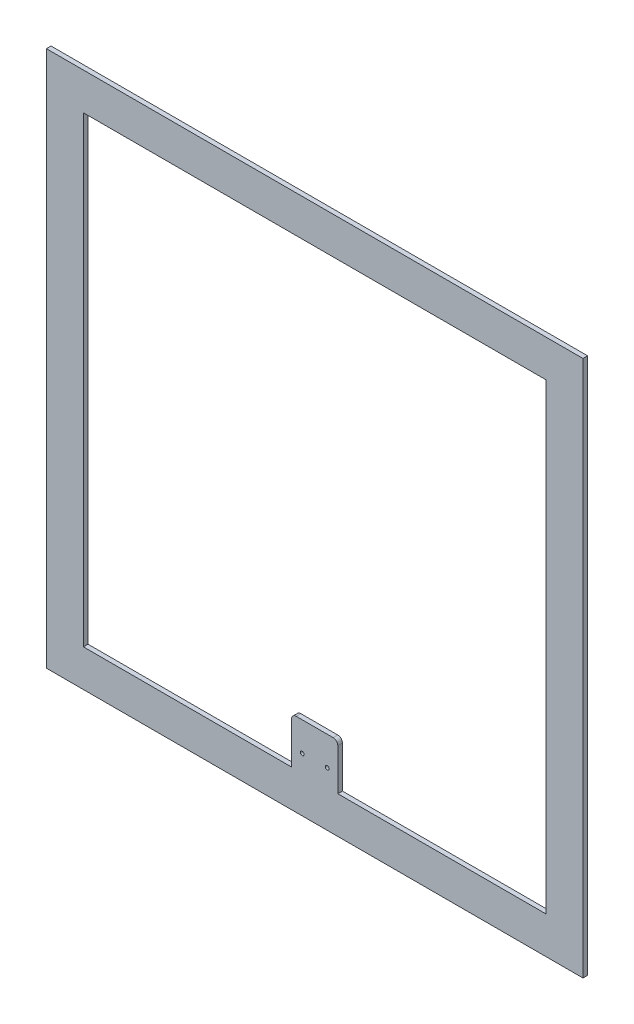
ISO-10303-21;
HEADER;
FILE_DESCRIPTION(('STEP AP214'),'2;1');
FILE_NAME('part.step','',(''),(''),'','','');
FILE_SCHEMA(('AUTOMOTIVE_DESIGN { 1 0 10303 214 1 1 1 1 }'));
ENDSEC;
DATA;
#1=APPLICATION_CONTEXT('core data for automotive mechanical design processes');
#2=APPLICATION_PROTOCOL_DEFINITION('international standard','automotive_design',2000,#1);
#3=PRODUCT_CONTEXT('',#1,'mechanical');
#4=PRODUCT('Part','Part','',(#3));
#5=PRODUCT_RELATED_PRODUCT_CATEGORY('part','',(#4));
#6=PRODUCT_DEFINITION_FORMATION('','',#4);
#7=PRODUCT_DEFINITION_CONTEXT('part definition',#1,'design');
#8=PRODUCT_DEFINITION('design','',#6,#7);
#9=PRODUCT_DEFINITION_SHAPE('','',#8);
#10=(LENGTH_UNIT() NAMED_UNIT(*) SI_UNIT(.MILLI.,.METRE.));
#11=(NAMED_UNIT(*) PLANE_ANGLE_UNIT() SI_UNIT($,.RADIAN.));
#12=(NAMED_UNIT(*) SI_UNIT($,.STERADIAN.) SOLID_ANGLE_UNIT());
#13=UNCERTAINTY_MEASURE_WITH_UNIT(LENGTH_MEASURE(1.E-05),#10,'distance_accuracy_value','');
#14=(GEOMETRIC_REPRESENTATION_CONTEXT(3) GLOBAL_UNCERTAINTY_ASSIGNED_CONTEXT((#13)) GLOBAL_UNIT_ASSIGNED_CONTEXT((#10,
#11,#12)) REPRESENTATION_CONTEXT('',''));
#15=CARTESIAN_POINT('',(0.,0.,0.));
#16=DIRECTION('',(0.,0.,1.));
#17=DIRECTION('',(1.,0.,0.));
#18=AXIS2_PLACEMENT_3D('',#15,#16,#17);
#19=CARTESIAN_POINT('',(0.,0.,5.));
#20=DIRECTION('',(0.,0.,1.));
#21=DIRECTION('',(1.,0.,0.));
#22=AXIS2_PLACEMENT_3D('',#19,#20,#21);
#23=PLANE('',#22);
#24=CARTESIAN_POINT('',(13.5,-231.5,5.));
#25=DIRECTION('',(0.,0.,1.));
#26=DIRECTION('',(-1.,0.,0.));
#27=AXIS2_PLACEMENT_3D('',#24,#25,#26);
#28=CIRCLE('',#27,2.);
#29=CARTESIAN_POINT('',(11.5,-231.5,5.));
#30=VERTEX_POINT('',#29);
#31=EDGE_CURVE('E305',#30,#30,#28,.T.);
#32=ORIENTED_EDGE('',*,*,#31,.F.);
#33=EDGE_LOOP('',(#32));
#34=FACE_BOUND('',#33,.T.);
#35=CARTESIAN_POINT('',(-13.5,-231.5,5.));
#36=DIRECTION('',(0.,0.,1.));
#37=DIRECTION('',(1.,0.,0.));
#38=AXIS2_PLACEMENT_3D('',#35,#36,#37);
#39=CIRCLE('',#38,2.);
#40=CARTESIAN_POINT('',(-11.5,-231.5,5.));
#41=VERTEX_POINT('',#40);
#42=EDGE_CURVE('E309',#41,#41,#39,.T.);
#43=ORIENTED_EDGE('',*,*,#42,.F.);
#44=EDGE_LOOP('',(#43));
#45=FACE_BOUND('',#44,.T.);
#46=DIRECTION('',(0.,1.,0.));
#47=VECTOR('',#46,1.);
#48=CARTESIAN_POINT('',(290.,290.,5.));
#49=LINE('',#48,#47);
#50=CARTESIAN_POINT('',(290.,-290.,5.));
#51=VERTEX_POINT('',#50);
#52=CARTESIAN_POINT('',(290.,290.,5.));
#53=VERTEX_POINT('',#52);
#54=EDGE_CURVE('E203',#51,#53,#49,.T.);
#55=ORIENTED_EDGE('',*,*,#54,.T.);
#56=DIRECTION('',(-1.,0.,0.));
#57=VECTOR('',#56,1.);
#58=CARTESIAN_POINT('',(-290.,290.,5.));
#59=LINE('',#58,#57);
#60=CARTESIAN_POINT('',(-290.,290.,5.));
#61=VERTEX_POINT('',#60);
#62=EDGE_CURVE('E206',#53,#61,#59,.T.);
#63=ORIENTED_EDGE('',*,*,#62,.T.);
#64=DIRECTION('',(0.,-1.,0.));
#65=VECTOR('',#64,1.);
#66=CARTESIAN_POINT('',(-290.,290.,5.));
#67=LINE('',#66,#65);
#68=CARTESIAN_POINT('',(-290.,-290.,5.));
#69=VERTEX_POINT('',#68);
#70=EDGE_CURVE('E209',#61,#69,#67,.T.);
#71=ORIENTED_EDGE('',*,*,#70,.T.);
#72=DIRECTION('',(1.,0.,0.));
#73=VECTOR('',#72,1.);
#74=CARTESIAN_POINT('',(-290.,-290.,5.));
#75=LINE('',#74,#73);
#76=EDGE_CURVE('E211',#69,#51,#75,.T.);
#77=ORIENTED_EDGE('',*,*,#76,.T.);
#78=EDGE_LOOP('',(#55,#63,#71,#77));
#79=FACE_BOUND('',#78,.T.);
#80=DIRECTION('',(0.,-1.,0.));
#81=VECTOR('',#80,1.);
#82=CARTESIAN_POINT('',(25.,-200.,5.));
#83=LINE('',#82,#81);
#84=CARTESIAN_POINT('',(25.,-205.,5.));
#85=VERTEX_POINT('',#84);
#86=CARTESIAN_POINT('',(25.,-250.,5.));
#87=VERTEX_POINT('',#86);
#88=EDGE_CURVE('E173',#85,#87,#83,.T.);
#89=ORIENTED_EDGE('',*,*,#88,.F.);
#90=CARTESIAN_POINT('',(20.,-205.,5.));
#91=DIRECTION('',(0.,0.,1.));
#92=DIRECTION('',(1.,0.,0.));
#93=AXIS2_PLACEMENT_3D('',#90,#91,#92);
#94=CIRCLE('',#93,5.);
#95=CARTESIAN_POINT('',(19.9999999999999,-200.,5.));
#96=VERTEX_POINT('',#95);
#97=EDGE_CURVE('E40',#85,#96,#94,.T.);
#98=ORIENTED_EDGE('',*,*,#97,.T.);
#99=DIRECTION('',(1.,0.,0.));
#100=VECTOR('',#99,1.);
#101=CARTESIAN_POINT('',(-25.,-200.,5.));
#102=LINE('',#101,#100);
#103=CARTESIAN_POINT('',(-20.,-200.,5.));
#104=VERTEX_POINT('',#103);
#105=EDGE_CURVE('E170',#104,#96,#102,.T.);
#106=ORIENTED_EDGE('',*,*,#105,.F.);
#107=CARTESIAN_POINT('',(-20.,-205.,5.));
#108=DIRECTION('',(0.,0.,1.));
#109=DIRECTION('',(1.,0.,0.));
#110=AXIS2_PLACEMENT_3D('',#107,#108,#109);
#111=CIRCLE('',#110,5.);
#112=CARTESIAN_POINT('',(-25.,-205.,5.));
#113=VERTEX_POINT('',#112);
#114=EDGE_CURVE('E47',#104,#113,#111,.T.);
#115=ORIENTED_EDGE('',*,*,#114,.T.);
#116=DIRECTION('',(0.,1.,0.));
#117=VECTOR('',#116,1.);
#118=CARTESIAN_POINT('',(-25.,-200.,5.));
#119=LINE('',#118,#117);
#120=CARTESIAN_POINT('',(-25.,-250.,5.));
#121=VERTEX_POINT('',#120);
#122=EDGE_CURVE('E168',#121,#113,#119,.T.);
#123=ORIENTED_EDGE('',*,*,#122,.F.);
#124=DIRECTION('',(1.,0.,0.));
#125=VECTOR('',#124,1.);
#126=CARTESIAN_POINT('',(-250.,-250.,5.));
#127=LINE('',#126,#125);
#128=CARTESIAN_POINT('',(-250.,-250.,5.));
#129=VERTEX_POINT('',#128);
#130=EDGE_CURVE('E166',#129,#121,#127,.T.);
#131=ORIENTED_EDGE('',*,*,#130,.F.);
#132=DIRECTION('',(0.,-1.,0.));
#133=VECTOR('',#132,1.);
#134=CARTESIAN_POINT('',(-250.,250.,5.));
#135=LINE('',#134,#133);
#136=CARTESIAN_POINT('',(-250.,250.,5.));
#137=VERTEX_POINT('',#136);
#138=EDGE_CURVE('E161',#137,#129,#135,.T.);
#139=ORIENTED_EDGE('',*,*,#138,.F.);
#140=DIRECTION('',(-1.,0.,0.));
#141=VECTOR('',#140,1.);
#142=CARTESIAN_POINT('',(-250.,250.,5.));
#143=LINE('',#142,#141);
#144=CARTESIAN_POINT('',(250.,250.,5.));
#145=VERTEX_POINT('',#144);
#146=EDGE_CURVE('E159',#145,#137,#143,.T.);
#147=ORIENTED_EDGE('',*,*,#146,.F.);
#148=DIRECTION('',(0.,1.,0.));
#149=VECTOR('',#148,1.);
#150=CARTESIAN_POINT('',(250.,250.,5.));
#151=LINE('',#150,#149);
#152=CARTESIAN_POINT('',(250.,-250.,5.));
#153=VERTEX_POINT('',#152);
#154=EDGE_CURVE('E146',#153,#145,#151,.T.);
#155=ORIENTED_EDGE('',*,*,#154,.F.);
#156=DIRECTION('',(1.,0.,0.));
#157=VECTOR('',#156,1.);
#158=CARTESIAN_POINT('',(25.,-250.,5.));
#159=LINE('',#158,#157);
#160=EDGE_CURVE('E137',#87,#153,#159,.T.);
#161=ORIENTED_EDGE('',*,*,#160,.F.);
#162=EDGE_LOOP('',(#89,#98,#106,#115,#123,#131,#139,#147,#155,#161));
#163=FACE_BOUND('',#162,.T.);
#164=ADVANCED_FACE('F32',(#34,#45,#79,#163),#23,.T.);
#165=CARTESIAN_POINT('',(0.,0.,0.));
#166=DIRECTION('',(0.,0.,1.));
#167=DIRECTION('',(1.,0.,0.));
#168=AXIS2_PLACEMENT_3D('',#165,#166,#167);
#169=PLANE('',#168);
#170=CARTESIAN_POINT('',(13.5,-231.5,0.));
#171=DIRECTION('',(0.,0.,1.));
#172=DIRECTION('',(1.,0.,0.));
#173=AXIS2_PLACEMENT_3D('',#170,#171,#172);
#174=CIRCLE('',#173,2.);
#175=CARTESIAN_POINT('',(15.5,-231.5,0.));
#176=VERTEX_POINT('',#175);
#177=EDGE_CURVE('E308',#176,#176,#174,.F.);
#178=ORIENTED_EDGE('',*,*,#177,.F.);
#179=EDGE_LOOP('',(#178));
#180=FACE_BOUND('',#179,.T.);
#181=CARTESIAN_POINT('',(-13.5,-231.5,0.));
#182=DIRECTION('',(0.,0.,1.));
#183=DIRECTION('',(1.,0.,0.));
#184=AXIS2_PLACEMENT_3D('',#181,#182,#183);
#185=CIRCLE('',#184,2.);
#186=CARTESIAN_POINT('',(-11.5,-231.5,0.));
#187=VERTEX_POINT('',#186);
#188=EDGE_CURVE('E177',#187,#187,#185,.F.);
#189=ORIENTED_EDGE('',*,*,#188,.F.);
#190=EDGE_LOOP('',(#189));
#191=FACE_BOUND('',#190,.T.);
#192=DIRECTION('',(0.,1.,0.));
#193=VECTOR('',#192,1.);
#194=CARTESIAN_POINT('',(290.,290.,0.));
#195=LINE('',#194,#193);
#196=CARTESIAN_POINT('',(290.,-290.,0.));
#197=VERTEX_POINT('',#196);
#198=CARTESIAN_POINT('',(290.,290.,0.));
#199=VERTEX_POINT('',#198);
#200=EDGE_CURVE('E154',#197,#199,#195,.T.);
#201=ORIENTED_EDGE('',*,*,#200,.F.);
#202=DIRECTION('',(1.,0.,0.));
#203=VECTOR('',#202,1.);
#204=CARTESIAN_POINT('',(-290.,-290.,0.));
#205=LINE('',#204,#203);
#206=CARTESIAN_POINT('',(-290.,-290.,0.));
#207=VERTEX_POINT('',#206);
#208=EDGE_CURVE('E207',#207,#197,#205,.T.);
#209=ORIENTED_EDGE('',*,*,#208,.F.);
#210=DIRECTION('',(0.,-1.,0.));
#211=VECTOR('',#210,1.);
#212=CARTESIAN_POINT('',(-290.,290.,0.));
#213=LINE('',#212,#211);
#214=CARTESIAN_POINT('',(-290.,290.,0.));
#215=VERTEX_POINT('',#214);
#216=EDGE_CURVE('E218',#215,#207,#213,.T.);
#217=ORIENTED_EDGE('',*,*,#216,.F.);
#218=DIRECTION('',(-1.,0.,0.));
#219=VECTOR('',#218,1.);
#220=CARTESIAN_POINT('',(-290.,290.,0.));
#221=LINE('',#220,#219);
#222=EDGE_CURVE('E216',#199,#215,#221,.T.);
#223=ORIENTED_EDGE('',*,*,#222,.F.);
#224=EDGE_LOOP('',(#201,#209,#217,#223));
#225=FACE_BOUND('',#224,.T.);
#226=DIRECTION('',(1.,0.,0.));
#227=VECTOR('',#226,1.);
#228=CARTESIAN_POINT('',(-25.,-200.,0.));
#229=LINE('',#228,#227);
#230=CARTESIAN_POINT('',(-20.,-200.,0.));
#231=VERTEX_POINT('',#230);
#232=CARTESIAN_POINT('',(19.9999999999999,-200.,0.));
#233=VERTEX_POINT('',#232);
#234=EDGE_CURVE('E191',#231,#233,#229,.T.);
#235=ORIENTED_EDGE('',*,*,#234,.T.);
#236=CARTESIAN_POINT('',(20.,-205.,0.));
#237=DIRECTION('',(0.,0.,1.));
#238=DIRECTION('',(1.,0.,0.));
#239=AXIS2_PLACEMENT_3D('',#236,#237,#238);
#240=CIRCLE('',#239,5.);
#241=CARTESIAN_POINT('',(25.,-205.,0.));
#242=VERTEX_POINT('',#241);
#243=EDGE_CURVE('E239',#233,#242,#240,.F.);
#244=ORIENTED_EDGE('',*,*,#243,.T.);
#245=DIRECTION('',(0.,-1.,0.));
#246=VECTOR('',#245,1.);
#247=CARTESIAN_POINT('',(25.,-200.,0.));
#248=LINE('',#247,#246);
#249=CARTESIAN_POINT('',(25.,-250.,0.));
#250=VERTEX_POINT('',#249);
#251=EDGE_CURVE('E147',#242,#250,#248,.T.);
#252=ORIENTED_EDGE('',*,*,#251,.T.);
#253=DIRECTION('',(1.,0.,0.));
#254=VECTOR('',#253,1.);
#255=CARTESIAN_POINT('',(25.,-250.,0.));
#256=LINE('',#255,#254);
#257=CARTESIAN_POINT('',(250.,-250.,0.));
#258=VERTEX_POINT('',#257);
#259=EDGE_CURVE('E175',#250,#258,#256,.T.);
#260=ORIENTED_EDGE('',*,*,#259,.T.);
#261=DIRECTION('',(0.,1.,0.));
#262=VECTOR('',#261,1.);
#263=CARTESIAN_POINT('',(250.,250.,0.));
#264=LINE('',#263,#262);
#265=CARTESIAN_POINT('',(250.,250.,0.));
#266=VERTEX_POINT('',#265);
#267=EDGE_CURVE('E153',#258,#266,#264,.T.);
#268=ORIENTED_EDGE('',*,*,#267,.T.);
#269=DIRECTION('',(-1.,0.,0.));
#270=VECTOR('',#269,1.);
#271=CARTESIAN_POINT('',(-250.,250.,0.));
#272=LINE('',#271,#270);
#273=CARTESIAN_POINT('',(-250.,250.,0.));
#274=VERTEX_POINT('',#273);
#275=EDGE_CURVE('E179',#266,#274,#272,.T.);
#276=ORIENTED_EDGE('',*,*,#275,.T.);
#277=DIRECTION('',(0.,-1.,0.));
#278=VECTOR('',#277,1.);
#279=CARTESIAN_POINT('',(-250.,250.,0.));
#280=LINE('',#279,#278);
#281=CARTESIAN_POINT('',(-250.,-250.,0.));
#282=VERTEX_POINT('',#281);
#283=EDGE_CURVE('E182',#274,#282,#280,.T.);
#284=ORIENTED_EDGE('',*,*,#283,.T.);
#285=DIRECTION('',(1.,0.,0.));
#286=VECTOR('',#285,1.);
#287=CARTESIAN_POINT('',(-250.,-250.,0.));
#288=LINE('',#287,#286);
#289=CARTESIAN_POINT('',(-25.,-250.,0.));
#290=VERTEX_POINT('',#289);
#291=EDGE_CURVE('E185',#282,#290,#288,.T.);
#292=ORIENTED_EDGE('',*,*,#291,.T.);
#293=DIRECTION('',(0.,1.,0.));
#294=VECTOR('',#293,1.);
#295=CARTESIAN_POINT('',(-25.,-200.,0.));
#296=LINE('',#295,#294);
#297=CARTESIAN_POINT('',(-25.,-205.,0.));
#298=VERTEX_POINT('',#297);
#299=EDGE_CURVE('E188',#290,#298,#296,.T.);
#300=ORIENTED_EDGE('',*,*,#299,.T.);
#301=CARTESIAN_POINT('',(-20.,-205.,0.));
#302=DIRECTION('',(0.,0.,1.));
#303=DIRECTION('',(1.,0.,0.));
#304=AXIS2_PLACEMENT_3D('',#301,#302,#303);
#305=CIRCLE('',#304,5.);
#306=EDGE_CURVE('E237',#298,#231,#305,.F.);
#307=ORIENTED_EDGE('',*,*,#306,.T.);
#308=EDGE_LOOP('',(#235,#244,#252,#260,#268,#276,#284,#292,#300,#307));
#309=FACE_BOUND('',#308,.T.);
#310=ADVANCED_FACE('F251',(#180,#191,#225,#309),#169,.F.);
#311=CARTESIAN_POINT('',(290.,290.,5.));
#312=DIRECTION('',(-1.,0.,0.));
#313=DIRECTION('',(0.,0.,1.));
#314=AXIS2_PLACEMENT_3D('',#311,#312,#313);
#315=PLANE('',#314);
#316=ORIENTED_EDGE('',*,*,#200,.T.);
#317=DIRECTION('',(0.,0.,-1.));
#318=VECTOR('',#317,1.);
#319=CARTESIAN_POINT('',(290.,290.,5.));
#320=LINE('',#319,#318);
#321=EDGE_CURVE('E229',#53,#199,#320,.T.);
#322=ORIENTED_EDGE('',*,*,#321,.F.);
#323=ORIENTED_EDGE('',*,*,#54,.F.);
#324=DIRECTION('',(0.,0.,-1.));
#325=VECTOR('',#324,1.);
#326=CARTESIAN_POINT('',(290.,-290.,5.));
#327=LINE('',#326,#325);
#328=EDGE_CURVE('E213',#51,#197,#327,.T.);
#329=ORIENTED_EDGE('',*,*,#328,.T.);
#330=EDGE_LOOP('',(#316,#322,#323,#329));
#331=FACE_BOUND('',#330,.T.);
#332=ADVANCED_FACE('F273',(#331),#315,.F.);
#333=CARTESIAN_POINT('',(-290.,290.,5.));
#334=DIRECTION('',(0.,-1.,0.));
#335=DIRECTION('',(0.,0.,-1.));
#336=AXIS2_PLACEMENT_3D('',#333,#334,#335);
#337=PLANE('',#336);
#338=ORIENTED_EDGE('',*,*,#222,.T.);
#339=DIRECTION('',(0.,0.,-1.));
#340=VECTOR('',#339,1.);
#341=CARTESIAN_POINT('',(-290.,290.,5.));
#342=LINE('',#341,#340);
#343=EDGE_CURVE('E226',#61,#215,#342,.T.);
#344=ORIENTED_EDGE('',*,*,#343,.F.);
#345=ORIENTED_EDGE('',*,*,#62,.F.);
#346=ORIENTED_EDGE('',*,*,#321,.T.);
#347=EDGE_LOOP('',(#338,#344,#345,#346));
#348=FACE_BOUND('',#347,.T.);
#349=ADVANCED_FACE('F288',(#348),#337,.F.);
#350=CARTESIAN_POINT('',(-290.,290.,5.));
#351=DIRECTION('',(1.,0.,0.));
#352=DIRECTION('',(0.,0.,-1.));
#353=AXIS2_PLACEMENT_3D('',#350,#351,#352);
#354=PLANE('',#353);
#355=ORIENTED_EDGE('',*,*,#216,.T.);
#356=DIRECTION('',(0.,0.,-1.));
#357=VECTOR('',#356,1.);
#358=CARTESIAN_POINT('',(-290.,-290.,5.));
#359=LINE('',#358,#357);
#360=EDGE_CURVE('E223',#69,#207,#359,.T.);
#361=ORIENTED_EDGE('',*,*,#360,.F.);
#362=ORIENTED_EDGE('',*,*,#70,.F.);
#363=ORIENTED_EDGE('',*,*,#343,.T.);
#364=EDGE_LOOP('',(#355,#361,#362,#363));
#365=FACE_BOUND('',#364,.T.);
#366=ADVANCED_FACE('F284',(#365),#354,.F.);
#367=CARTESIAN_POINT('',(-290.,-290.,5.));
#368=DIRECTION('',(0.,1.,0.));
#369=DIRECTION('',(0.,0.,1.));
#370=AXIS2_PLACEMENT_3D('',#367,#368,#369);
#371=PLANE('',#370);
#372=ORIENTED_EDGE('',*,*,#208,.T.);
#373=ORIENTED_EDGE('',*,*,#328,.F.);
#374=ORIENTED_EDGE('',*,*,#76,.F.);
#375=ORIENTED_EDGE('',*,*,#360,.T.);
#376=EDGE_LOOP('',(#372,#373,#374,#375));
#377=FACE_BOUND('',#376,.T.);
#378=ADVANCED_FACE('F281',(#377),#371,.F.);
#379=CARTESIAN_POINT('',(25.,-250.,5.));
#380=DIRECTION('',(0.,1.,0.));
#381=DIRECTION('',(0.,0.,1.));
#382=AXIS2_PLACEMENT_3D('',#379,#380,#381);
#383=PLANE('',#382);
#384=ORIENTED_EDGE('',*,*,#259,.F.);
#385=DIRECTION('',(0.,0.,-1.));
#386=VECTOR('',#385,1.);
#387=CARTESIAN_POINT('',(25.,-250.,5.));
#388=LINE('',#387,#386);
#389=EDGE_CURVE('E144',#87,#250,#388,.T.);
#390=ORIENTED_EDGE('',*,*,#389,.F.);
#391=ORIENTED_EDGE('',*,*,#160,.T.);
#392=DIRECTION('',(0.,0.,-1.));
#393=VECTOR('',#392,1.);
#394=CARTESIAN_POINT('',(250.,-250.,5.));
#395=LINE('',#394,#393);
#396=EDGE_CURVE('E141',#153,#258,#395,.T.);
#397=ORIENTED_EDGE('',*,*,#396,.T.);
#398=EDGE_LOOP('',(#384,#390,#391,#397));
#399=FACE_BOUND('',#398,.T.);
#400=ADVANCED_FACE('F140',(#399),#383,.T.);
#401=CARTESIAN_POINT('',(250.,250.,5.));
#402=DIRECTION('',(-1.,0.,0.));
#403=DIRECTION('',(0.,0.,1.));
#404=AXIS2_PLACEMENT_3D('',#401,#402,#403);
#405=PLANE('',#404);
#406=ORIENTED_EDGE('',*,*,#267,.F.);
#407=ORIENTED_EDGE('',*,*,#396,.F.);
#408=ORIENTED_EDGE('',*,*,#154,.T.);
#409=DIRECTION('',(0.,0.,-1.));
#410=VECTOR('',#409,1.);
#411=CARTESIAN_POINT('',(250.,250.,5.));
#412=LINE('',#411,#410);
#413=EDGE_CURVE('E155',#145,#266,#412,.T.);
#414=ORIENTED_EDGE('',*,*,#413,.T.);
#415=EDGE_LOOP('',(#406,#407,#408,#414));
#416=FACE_BOUND('',#415,.T.);
#417=ADVANCED_FACE('F150',(#416),#405,.T.);
#418=CARTESIAN_POINT('',(-250.,250.,5.));
#419=DIRECTION('',(0.,-1.,0.));
#420=DIRECTION('',(0.,0.,-1.));
#421=AXIS2_PLACEMENT_3D('',#418,#419,#420);
#422=PLANE('',#421);
#423=ORIENTED_EDGE('',*,*,#275,.F.);
#424=ORIENTED_EDGE('',*,*,#413,.F.);
#425=ORIENTED_EDGE('',*,*,#146,.T.);
#426=DIRECTION('',(0.,0.,-1.));
#427=VECTOR('',#426,1.);
#428=CARTESIAN_POINT('',(-250.,250.,5.));
#429=LINE('',#428,#427);
#430=EDGE_CURVE('E200',#137,#274,#429,.T.);
#431=ORIENTED_EDGE('',*,*,#430,.T.);
#432=EDGE_LOOP('',(#423,#424,#425,#431));
#433=FACE_BOUND('',#432,.T.);
#434=ADVANCED_FACE('F369',(#433),#422,.T.);
#435=CARTESIAN_POINT('',(-250.,250.,5.));
#436=DIRECTION('',(1.,0.,0.));
#437=DIRECTION('',(0.,0.,-1.));
#438=AXIS2_PLACEMENT_3D('',#435,#436,#437);
#439=PLANE('',#438);
#440=ORIENTED_EDGE('',*,*,#283,.F.);
#441=ORIENTED_EDGE('',*,*,#430,.F.);
#442=ORIENTED_EDGE('',*,*,#138,.T.);
#443=DIRECTION('',(0.,0.,-1.));
#444=VECTOR('',#443,1.);
#445=CARTESIAN_POINT('',(-250.,-250.,5.));
#446=LINE('',#445,#444);
#447=EDGE_CURVE('E198',#129,#282,#446,.T.);
#448=ORIENTED_EDGE('',*,*,#447,.T.);
#449=EDGE_LOOP('',(#440,#441,#442,#448));
#450=FACE_BOUND('',#449,.T.);
#451=ADVANCED_FACE('F362',(#450),#439,.T.);
#452=CARTESIAN_POINT('',(-250.,-250.,5.));
#453=DIRECTION('',(0.,1.,0.));
#454=DIRECTION('',(-1.,0.,0.));
#455=AXIS2_PLACEMENT_3D('',#452,#453,#454);
#456=PLANE('',#455);
#457=ORIENTED_EDGE('',*,*,#291,.F.);
#458=ORIENTED_EDGE('',*,*,#447,.F.);
#459=ORIENTED_EDGE('',*,*,#130,.T.);
#460=DIRECTION('',(0.,0.,-1.));
#461=VECTOR('',#460,1.);
#462=CARTESIAN_POINT('',(-25.,-250.,5.));
#463=LINE('',#462,#461);
#464=EDGE_CURVE('E196',#121,#290,#463,.T.);
#465=ORIENTED_EDGE('',*,*,#464,.T.);
#466=EDGE_LOOP('',(#457,#458,#459,#465));
#467=FACE_BOUND('',#466,.T.);
#468=ADVANCED_FACE('F353',(#467),#456,.T.);
#469=CARTESIAN_POINT('',(-25.,-200.,5.));
#470=DIRECTION('',(-1.,0.,0.));
#471=DIRECTION('',(0.,-1.,0.));
#472=AXIS2_PLACEMENT_3D('',#469,#470,#471);
#473=PLANE('',#472);
#474=ORIENTED_EDGE('',*,*,#122,.T.);
#475=DIRECTION('',(0.,0.,-1.));
#476=VECTOR('',#475,1.);
#477=CARTESIAN_POINT('',(-25.,-205.,5.));
#478=LINE('',#477,#476);
#479=EDGE_CURVE('E11',#113,#298,#478,.T.);
#480=ORIENTED_EDGE('',*,*,#479,.T.);
#481=ORIENTED_EDGE('',*,*,#299,.F.);
#482=ORIENTED_EDGE('',*,*,#464,.F.);
#483=EDGE_LOOP('',(#474,#480,#481,#482));
#484=FACE_BOUND('',#483,.T.);
#485=ADVANCED_FACE('F264',(#484),#473,.T.);
#486=CARTESIAN_POINT('',(-25.,-200.,5.));
#487=DIRECTION('',(0.,1.,0.));
#488=DIRECTION('',(0.,0.,1.));
#489=AXIS2_PLACEMENT_3D('',#486,#487,#488);
#490=PLANE('',#489);
#491=ORIENTED_EDGE('',*,*,#105,.T.);
#492=DIRECTION('',(0.,0.,-1.));
#493=VECTOR('',#492,1.);
#494=CARTESIAN_POINT('',(20.,-200.,5.));
#495=LINE('',#494,#493);
#496=EDGE_CURVE('E234',#96,#233,#495,.T.);
#497=ORIENTED_EDGE('',*,*,#496,.T.);
#498=ORIENTED_EDGE('',*,*,#234,.F.);
#499=DIRECTION('',(0.,0.,-1.));
#500=VECTOR('',#499,1.);
#501=CARTESIAN_POINT('',(-20.,-200.,5.));
#502=LINE('',#501,#500);
#503=EDGE_CURVE('E232',#231,#104,#502,.F.);
#504=ORIENTED_EDGE('',*,*,#503,.T.);
#505=EDGE_LOOP('',(#491,#497,#498,#504));
#506=FACE_BOUND('',#505,.T.);
#507=ADVANCED_FACE('F246',(#506),#490,.T.);
#508=CARTESIAN_POINT('',(25.,-200.,5.));
#509=DIRECTION('',(1.,0.,0.));
#510=DIRECTION('',(0.,1.,0.));
#511=AXIS2_PLACEMENT_3D('',#508,#509,#510);
#512=PLANE('',#511);
#513=ORIENTED_EDGE('',*,*,#251,.F.);
#514=DIRECTION('',(0.,0.,-1.));
#515=VECTOR('',#514,1.);
#516=CARTESIAN_POINT('',(25.,-205.,5.));
#517=LINE('',#516,#515);
#518=EDGE_CURVE('E55',#242,#85,#517,.F.);
#519=ORIENTED_EDGE('',*,*,#518,.T.);
#520=ORIENTED_EDGE('',*,*,#88,.T.);
#521=ORIENTED_EDGE('',*,*,#389,.T.);
#522=EDGE_LOOP('',(#513,#519,#520,#521));
#523=FACE_BOUND('',#522,.T.);
#524=ADVANCED_FACE('F252',(#523),#512,.T.);
#525=CARTESIAN_POINT('',(-13.5,-231.5,-0.00100000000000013));
#526=DIRECTION('',(0.,0.,1.));
#527=DIRECTION('',(1.,0.,0.));
#528=AXIS2_PLACEMENT_3D('',#525,#526,#527);
#529=CYLINDRICAL_SURFACE('',#528,2.);
#530=ORIENTED_EDGE('',*,*,#42,.T.);
#531=EDGE_LOOP('',(#530));
#532=FACE_BOUND('',#531,.T.);
#533=ORIENTED_EDGE('',*,*,#188,.T.);
#534=EDGE_LOOP('',(#533));
#535=FACE_BOUND('',#534,.T.);
#536=ADVANCED_FACE('F254',(#532,#535),#529,.F.);
#537=CARTESIAN_POINT('',(13.5,-231.5,-0.00100000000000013));
#538=DIRECTION('',(0.,0.,1.));
#539=DIRECTION('',(1.,0.,0.));
#540=AXIS2_PLACEMENT_3D('',#537,#538,#539);
#541=CYLINDRICAL_SURFACE('',#540,2.);
#542=ORIENTED_EDGE('',*,*,#31,.T.);
#543=EDGE_LOOP('',(#542));
#544=FACE_BOUND('',#543,.T.);
#545=ORIENTED_EDGE('',*,*,#177,.T.);
#546=EDGE_LOOP('',(#545));
#547=FACE_BOUND('',#546,.T.);
#548=ADVANCED_FACE('F261',(#544,#547),#541,.F.);
#549=CARTESIAN_POINT('',(20.,-205.,5.));
#550=DIRECTION('',(0.,0.,-1.));
#551=DIRECTION('',(-1.,0.,0.));
#552=AXIS2_PLACEMENT_3D('',#549,#550,#551);
#553=CYLINDRICAL_SURFACE('',#552,5.);
#554=ORIENTED_EDGE('',*,*,#97,.F.);
#555=ORIENTED_EDGE('',*,*,#518,.F.);
#556=ORIENTED_EDGE('',*,*,#243,.F.);
#557=ORIENTED_EDGE('',*,*,#496,.F.);
#558=EDGE_LOOP('',(#554,#555,#556,#557));
#559=FACE_BOUND('',#558,.T.);
#560=ADVANCED_FACE('F249',(#559),#553,.T.);
#561=CARTESIAN_POINT('',(-20.,-205.,5.));
#562=DIRECTION('',(0.,0.,-1.));
#563=DIRECTION('',(-1.,0.,0.));
#564=AXIS2_PLACEMENT_3D('',#561,#562,#563);
#565=CYLINDRICAL_SURFACE('',#564,5.);
#566=ORIENTED_EDGE('',*,*,#114,.F.);
#567=ORIENTED_EDGE('',*,*,#503,.F.);
#568=ORIENTED_EDGE('',*,*,#306,.F.);
#569=ORIENTED_EDGE('',*,*,#479,.F.);
#570=EDGE_LOOP('',(#566,#567,#568,#569));
#571=FACE_BOUND('',#570,.T.);
#572=ADVANCED_FACE('F34',(#571),#565,.T.);
#573=CLOSED_SHELL('',(#164,#310,#332,#349,#366,#378,#400,#417,#434,#451,#468,#485,#507,#524,
#536,#548,#560,#572));
#574=MANIFOLD_SOLID_BREP('B2',#573);
#575=ADVANCED_BREP_SHAPE_REPRESENTATION('',(#18,#574),#14);
#576=SHAPE_DEFINITION_REPRESENTATION(#9,#575);
ENDSEC;
END-ISO-10303-21;
